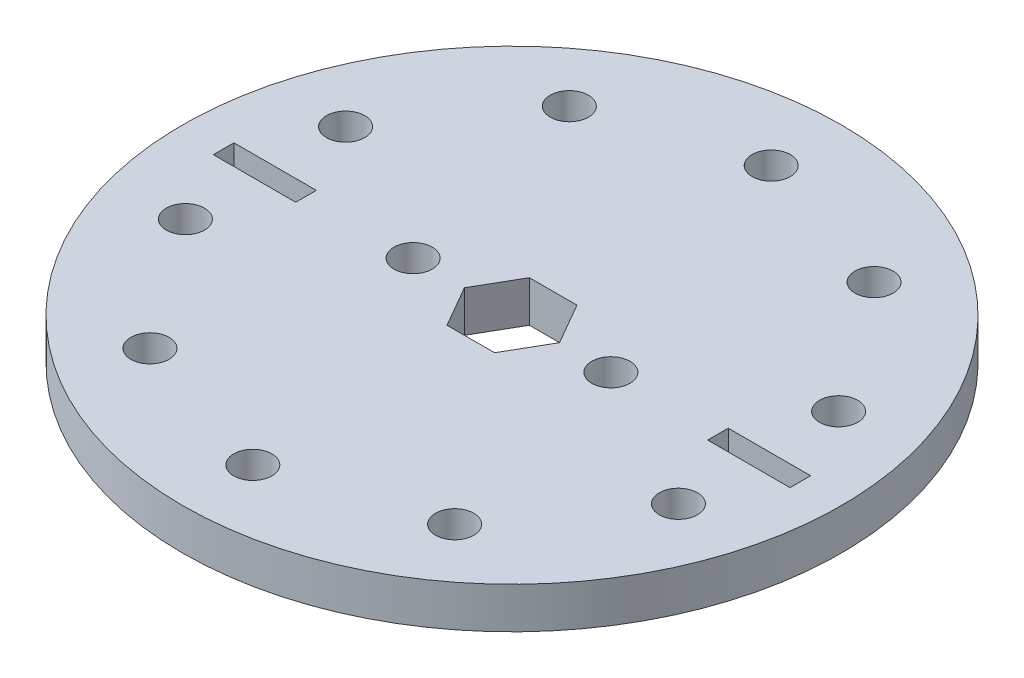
ISO-10303-21;
HEADER;
FILE_DESCRIPTION(('STEP AP214'),'2;1');
FILE_NAME('part.step','',(''),(''),'','','');
FILE_SCHEMA(('AUTOMOTIVE_DESIGN { 1 0 10303 214 1 1 1 1 }'));
ENDSEC;
DATA;
#1=APPLICATION_CONTEXT('core data for automotive mechanical design processes');
#2=APPLICATION_PROTOCOL_DEFINITION('international standard','automotive_design',2000,#1);
#3=PRODUCT_CONTEXT('',#1,'mechanical');
#4=PRODUCT('Part','Part','',(#3));
#5=PRODUCT_RELATED_PRODUCT_CATEGORY('part','',(#4));
#6=PRODUCT_DEFINITION_FORMATION('','',#4);
#7=PRODUCT_DEFINITION_CONTEXT('part definition',#1,'design');
#8=PRODUCT_DEFINITION('design','',#6,#7);
#9=PRODUCT_DEFINITION_SHAPE('','',#8);
#10=(LENGTH_UNIT() NAMED_UNIT(*) SI_UNIT(.MILLI.,.METRE.));
#11=(NAMED_UNIT(*) PLANE_ANGLE_UNIT() SI_UNIT($,.RADIAN.));
#12=(NAMED_UNIT(*) SI_UNIT($,.STERADIAN.) SOLID_ANGLE_UNIT());
#13=UNCERTAINTY_MEASURE_WITH_UNIT(LENGTH_MEASURE(1.E-05),#10,'distance_accuracy_value','');
#14=(GEOMETRIC_REPRESENTATION_CONTEXT(3) GLOBAL_UNCERTAINTY_ASSIGNED_CONTEXT((#13)) GLOBAL_UNIT_ASSIGNED_CONTEXT((#10,
#11,#12)) REPRESENTATION_CONTEXT('',''));
#15=CARTESIAN_POINT('',(0.,0.,0.));
#16=DIRECTION('',(0.,0.,1.));
#17=DIRECTION('',(1.,0.,0.));
#18=AXIS2_PLACEMENT_3D('',#15,#16,#17);
#19=CARTESIAN_POINT('',(0.,3.175,0.));
#20=DIRECTION('',(0.,1.,0.));
#21=DIRECTION('',(0.,0.,1.));
#22=AXIS2_PLACEMENT_3D('',#19,#20,#21);
#23=PLANE('',#22);
#24=DIRECTION('',(-1.,0.,0.));
#25=VECTOR('',#24,1.);
#26=CARTESIAN_POINT('',(22.225,3.175,-0.793749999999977));
#27=LINE('',#26,#25);
#28=CARTESIAN_POINT('',(22.225,3.175,-0.793749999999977));
#29=VERTEX_POINT('',#28);
#30=CARTESIAN_POINT('',(15.875,3.175,-0.793749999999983));
#31=VERTEX_POINT('',#30);
#32=EDGE_CURVE('E48',#29,#31,#27,.T.);
#33=ORIENTED_EDGE('',*,*,#32,.F.);
#34=DIRECTION('',(0.,0.,-1.));
#35=VECTOR('',#34,1.);
#36=CARTESIAN_POINT('',(22.225,3.175,-0.793749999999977));
#37=LINE('',#36,#35);
#38=CARTESIAN_POINT('',(22.225,3.175,0.793750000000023));
#39=VERTEX_POINT('',#38);
#40=EDGE_CURVE('E152',#39,#29,#37,.T.);
#41=ORIENTED_EDGE('',*,*,#40,.F.);
#42=DIRECTION('',(1.,0.,0.));
#43=VECTOR('',#42,1.);
#44=CARTESIAN_POINT('',(22.225,3.175,0.793750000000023));
#45=LINE('',#44,#43);
#46=CARTESIAN_POINT('',(15.875,3.175,0.793750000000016));
#47=VERTEX_POINT('',#46);
#48=EDGE_CURVE('E155',#47,#39,#45,.T.);
#49=ORIENTED_EDGE('',*,*,#48,.F.);
#50=DIRECTION('',(0.,0.,1.));
#51=VECTOR('',#50,1.);
#52=CARTESIAN_POINT('',(15.875,3.175,-0.793749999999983));
#53=LINE('',#52,#51);
#54=EDGE_CURVE('E161',#31,#47,#53,.T.);
#55=ORIENTED_EDGE('',*,*,#54,.F.);
#56=EDGE_LOOP('',(#33,#41,#49,#55));
#57=FACE_BOUND('',#56,.T.);
#58=DIRECTION('',(0.,0.,1.));
#59=VECTOR('',#58,1.);
#60=CARTESIAN_POINT('',(-22.225,3.175,-0.79375));
#61=LINE('',#60,#59);
#62=CARTESIAN_POINT('',(-22.225,3.175,-0.79375));
#63=VERTEX_POINT('',#62);
#64=CARTESIAN_POINT('',(-22.225,3.175,0.793750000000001));
#65=VERTEX_POINT('',#64);
#66=EDGE_CURVE('E167',#63,#65,#61,.T.);
#67=ORIENTED_EDGE('',*,*,#66,.F.);
#68=DIRECTION('',(-1.,0.,0.));
#69=VECTOR('',#68,1.);
#70=CARTESIAN_POINT('',(-22.225,3.175,-0.79375));
#71=LINE('',#70,#69);
#72=CARTESIAN_POINT('',(-15.875,3.175,-0.793749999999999));
#73=VERTEX_POINT('',#72);
#74=EDGE_CURVE('E175',#73,#63,#71,.T.);
#75=ORIENTED_EDGE('',*,*,#74,.F.);
#76=DIRECTION('',(0.,0.,-1.));
#77=VECTOR('',#76,1.);
#78=CARTESIAN_POINT('',(-15.875,3.175,-0.793749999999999));
#79=LINE('',#78,#77);
#80=CARTESIAN_POINT('',(-15.875,3.175,0.793750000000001));
#81=VERTEX_POINT('',#80);
#82=EDGE_CURVE('E189',#81,#73,#79,.T.);
#83=ORIENTED_EDGE('',*,*,#82,.F.);
#84=DIRECTION('',(1.,0.,0.));
#85=VECTOR('',#84,1.);
#86=CARTESIAN_POINT('',(-22.225,3.175,0.793750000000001));
#87=LINE('',#86,#85);
#88=EDGE_CURVE('E186',#65,#81,#87,.T.);
#89=ORIENTED_EDGE('',*,*,#88,.F.);
#90=EDGE_LOOP('',(#67,#75,#83,#89));
#91=FACE_BOUND('',#90,.T.);
#92=CARTESIAN_POINT('',(0.,3.175,-19.9777822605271));
#93=DIRECTION('',(0.,1.,0.));
#94=DIRECTION('',(0.,0.,1.));
#95=AXIS2_PLACEMENT_3D('',#92,#93,#94);
#96=CIRCLE('',#95,1.4732);
#97=CARTESIAN_POINT('',(0.,3.175,-18.5045822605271));
#98=VERTEX_POINT('',#97);
#99=EDGE_CURVE('E196',#98,#98,#96,.T.);
#100=ORIENTED_EDGE('',*,*,#99,.F.);
#101=EDGE_LOOP('',(#100));
#102=FACE_BOUND('',#101,.T.);
#103=CARTESIAN_POINT('',(-11.742645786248,3.175,-16.1623653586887));
#104=DIRECTION('',(0.,1.,0.));
#105=DIRECTION('',(0.,0.,1.));
#106=AXIS2_PLACEMENT_3D('',#103,#104,#105);
#107=CIRCLE('',#106,1.4732);
#108=CARTESIAN_POINT('',(-11.742645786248,3.175,-14.6891653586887));
#109=VERTEX_POINT('',#108);
#110=EDGE_CURVE('E208',#109,#109,#107,.T.);
#111=ORIENTED_EDGE('',*,*,#110,.F.);
#112=EDGE_LOOP('',(#111));
#113=FACE_BOUND('',#112,.T.);
#114=CARTESIAN_POINT('',(-19.,3.175,-6.1734742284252));
#115=DIRECTION('',(0.,1.,0.));
#116=DIRECTION('',(0.,0.,1.));
#117=AXIS2_PLACEMENT_3D('',#114,#115,#116);
#118=CIRCLE('',#117,1.4732);
#119=CARTESIAN_POINT('',(-19.,3.175,-4.70027422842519));
#120=VERTEX_POINT('',#119);
#121=EDGE_CURVE('E214',#120,#120,#118,.T.);
#122=ORIENTED_EDGE('',*,*,#121,.F.);
#123=EDGE_LOOP('',(#122));
#124=FACE_BOUND('',#123,.T.);
#125=CARTESIAN_POINT('',(-19.,3.175,6.17347422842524));
#126=DIRECTION('',(0.,1.,0.));
#127=DIRECTION('',(0.,0.,1.));
#128=AXIS2_PLACEMENT_3D('',#125,#126,#127);
#129=CIRCLE('',#128,1.4732);
#130=CARTESIAN_POINT('',(-19.,3.175,7.64667422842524));
#131=VERTEX_POINT('',#130);
#132=EDGE_CURVE('E220',#131,#131,#129,.T.);
#133=ORIENTED_EDGE('',*,*,#132,.F.);
#134=EDGE_LOOP('',(#133));
#135=FACE_BOUND('',#134,.T.);
#136=CARTESIAN_POINT('',(-11.742645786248,3.175,16.1623653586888));
#137=DIRECTION('',(0.,1.,0.));
#138=DIRECTION('',(0.,0.,1.));
#139=AXIS2_PLACEMENT_3D('',#136,#137,#138);
#140=CIRCLE('',#139,1.4732);
#141=CARTESIAN_POINT('',(-11.742645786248,3.175,17.6355653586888));
#142=VERTEX_POINT('',#141);
#143=EDGE_CURVE('E226',#142,#142,#140,.T.);
#144=ORIENTED_EDGE('',*,*,#143,.F.);
#145=EDGE_LOOP('',(#144));
#146=FACE_BOUND('',#145,.T.);
#147=CARTESIAN_POINT('',(0.,3.175,19.9777822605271));
#148=DIRECTION('',(0.,1.,0.));
#149=DIRECTION('',(0.,0.,1.));
#150=AXIS2_PLACEMENT_3D('',#147,#148,#149);
#151=CIRCLE('',#150,1.4732);
#152=CARTESIAN_POINT('',(0.,3.175,21.4509822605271));
#153=VERTEX_POINT('',#152);
#154=EDGE_CURVE('E232',#153,#153,#151,.T.);
#155=ORIENTED_EDGE('',*,*,#154,.F.);
#156=EDGE_LOOP('',(#155));
#157=FACE_BOUND('',#156,.T.);
#158=CARTESIAN_POINT('',(11.742645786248,3.175,16.1623653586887));
#159=DIRECTION('',(0.,1.,0.));
#160=DIRECTION('',(0.,0.,1.));
#161=AXIS2_PLACEMENT_3D('',#158,#159,#160);
#162=CIRCLE('',#161,1.4732);
#163=CARTESIAN_POINT('',(11.742645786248,3.175,17.6355653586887));
#164=VERTEX_POINT('',#163);
#165=EDGE_CURVE('E238',#164,#164,#162,.T.);
#166=ORIENTED_EDGE('',*,*,#165,.F.);
#167=EDGE_LOOP('',(#166));
#168=FACE_BOUND('',#167,.T.);
#169=CARTESIAN_POINT('',(19.,3.175,6.1734742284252));
#170=DIRECTION('',(0.,1.,0.));
#171=DIRECTION('',(0.,0.,1.));
#172=AXIS2_PLACEMENT_3D('',#169,#170,#171);
#173=CIRCLE('',#172,1.4732);
#174=CARTESIAN_POINT('',(19.,3.175,7.6466742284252));
#175=VERTEX_POINT('',#174);
#176=EDGE_CURVE('E244',#175,#175,#173,.T.);
#177=ORIENTED_EDGE('',*,*,#176,.F.);
#178=EDGE_LOOP('',(#177));
#179=FACE_BOUND('',#178,.T.);
#180=CARTESIAN_POINT('',(19.,3.175,-6.17347422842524));
#181=DIRECTION('',(0.,1.,0.));
#182=DIRECTION('',(0.,0.,1.));
#183=AXIS2_PLACEMENT_3D('',#180,#181,#182);
#184=CIRCLE('',#183,1.4732);
#185=CARTESIAN_POINT('',(19.,3.175,-4.70027422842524));
#186=VERTEX_POINT('',#185);
#187=EDGE_CURVE('E250',#186,#186,#184,.T.);
#188=ORIENTED_EDGE('',*,*,#187,.F.);
#189=EDGE_LOOP('',(#188));
#190=FACE_BOUND('',#189,.T.);
#191=CARTESIAN_POINT('',(11.742645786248,3.175,-16.1623653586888));
#192=DIRECTION('',(0.,1.,0.));
#193=DIRECTION('',(0.,0.,1.));
#194=AXIS2_PLACEMENT_3D('',#191,#192,#193);
#195=CIRCLE('',#194,1.4732);
#196=CARTESIAN_POINT('',(11.742645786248,3.175,-14.6891653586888));
#197=VERTEX_POINT('',#196);
#198=EDGE_CURVE('E256',#197,#197,#195,.T.);
#199=ORIENTED_EDGE('',*,*,#198,.F.);
#200=EDGE_LOOP('',(#199));
#201=FACE_BOUND('',#200,.T.);
#202=CARTESIAN_POINT('',(-7.62,3.175,0.));
#203=DIRECTION('',(0.,1.,0.));
#204=DIRECTION('',(0.,0.,1.));
#205=AXIS2_PLACEMENT_3D('',#202,#203,#204);
#206=CIRCLE('',#205,1.4732);
#207=CARTESIAN_POINT('',(-7.62,3.175,1.4732));
#208=VERTEX_POINT('',#207);
#209=EDGE_CURVE('E262',#208,#208,#206,.T.);
#210=ORIENTED_EDGE('',*,*,#209,.F.);
#211=EDGE_LOOP('',(#210));
#212=FACE_BOUND('',#211,.T.);
#213=CARTESIAN_POINT('',(7.62,3.175,0.));
#214=DIRECTION('',(0.,1.,0.));
#215=DIRECTION('',(0.,0.,1.));
#216=AXIS2_PLACEMENT_3D('',#213,#214,#215);
#217=CIRCLE('',#216,1.4732);
#218=CARTESIAN_POINT('',(7.62,3.175,1.4732));
#219=VERTEX_POINT('',#218);
#220=EDGE_CURVE('E268',#219,#219,#217,.T.);
#221=ORIENTED_EDGE('',*,*,#220,.F.);
#222=EDGE_LOOP('',(#221));
#223=FACE_BOUND('',#222,.T.);
#224=CARTESIAN_POINT('',(0.,3.175,0.));
#225=DIRECTION('',(0.,1.,0.));
#226=DIRECTION('',(0.,0.,1.));
#227=AXIS2_PLACEMENT_3D('',#224,#225,#226);
#228=CIRCLE('',#227,25.4);
#229=CARTESIAN_POINT('',(0.,3.175,25.4));
#230=VERTEX_POINT('',#229);
#231=EDGE_CURVE('E11',#230,#230,#228,.T.);
#232=ORIENTED_EDGE('',*,*,#231,.T.);
#233=EDGE_LOOP('',(#232));
#234=FACE_BOUND('',#233,.T.);
#235=DIRECTION('',(-1.,0.,0.));
#236=VECTOR('',#235,1.);
#237=CARTESIAN_POINT('',(1.83308710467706,3.175,-3.175));
#238=LINE('',#237,#236);
#239=CARTESIAN_POINT('',(1.83308710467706,3.175,-3.175));
#240=VERTEX_POINT('',#239);
#241=CARTESIAN_POINT('',(-1.83308710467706,3.175,-3.175));
#242=VERTEX_POINT('',#241);
#243=EDGE_CURVE('E277',#240,#242,#238,.T.);
#244=ORIENTED_EDGE('',*,*,#243,.F.);
#245=DIRECTION('',(-0.5,0.,-0.866025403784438));
#246=VECTOR('',#245,1.);
#247=CARTESIAN_POINT('',(3.66617420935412,3.175,0.));
#248=LINE('',#247,#246);
#249=CARTESIAN_POINT('',(3.66617420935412,3.175,0.));
#250=VERTEX_POINT('',#249);
#251=EDGE_CURVE('E275',#250,#240,#248,.T.);
#252=ORIENTED_EDGE('',*,*,#251,.F.);
#253=DIRECTION('',(0.5,0.,-0.866025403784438));
#254=VECTOR('',#253,1.);
#255=CARTESIAN_POINT('',(1.83308710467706,3.175,3.175));
#256=LINE('',#255,#254);
#257=CARTESIAN_POINT('',(1.83308710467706,3.175,3.175));
#258=VERTEX_POINT('',#257);
#259=EDGE_CURVE('E287',#258,#250,#256,.T.);
#260=ORIENTED_EDGE('',*,*,#259,.F.);
#261=DIRECTION('',(1.,0.,0.));
#262=VECTOR('',#261,1.);
#263=CARTESIAN_POINT('',(-1.83308710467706,3.175,3.175));
#264=LINE('',#263,#262);
#265=CARTESIAN_POINT('',(-1.83308710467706,3.175,3.175));
#266=VERTEX_POINT('',#265);
#267=EDGE_CURVE('E284',#266,#258,#264,.T.);
#268=ORIENTED_EDGE('',*,*,#267,.F.);
#269=DIRECTION('',(0.5,0.,0.866025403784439));
#270=VECTOR('',#269,1.);
#271=CARTESIAN_POINT('',(-3.66617420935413,3.175,0.));
#272=LINE('',#271,#270);
#273=CARTESIAN_POINT('',(-3.66617420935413,3.175,0.));
#274=VERTEX_POINT('',#273);
#275=EDGE_CURVE('E282',#274,#266,#272,.T.);
#276=ORIENTED_EDGE('',*,*,#275,.F.);
#277=DIRECTION('',(-0.5,0.,0.866025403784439));
#278=VECTOR('',#277,1.);
#279=CARTESIAN_POINT('',(-1.83308710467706,3.175,-3.175));
#280=LINE('',#279,#278);
#281=EDGE_CURVE('E280',#242,#274,#280,.T.);
#282=ORIENTED_EDGE('',*,*,#281,.F.);
#283=EDGE_LOOP('',(#244,#252,#260,#268,#276,#282));
#284=FACE_BOUND('',#283,.T.);
#285=ADVANCED_FACE('F33',(#57,#91,#102,#113,#124,#135,#146,#157,#168,#179,#190,#201,#212,#223,
#234,#284),#23,.T.);
#286=CARTESIAN_POINT('',(0.,0.,0.));
#287=DIRECTION('',(0.,1.,0.));
#288=DIRECTION('',(0.,0.,1.));
#289=AXIS2_PLACEMENT_3D('',#286,#287,#288);
#290=PLANE('',#289);
#291=DIRECTION('',(0.,0.,-1.));
#292=VECTOR('',#291,1.);
#293=CARTESIAN_POINT('',(22.225,0.,-0.793749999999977));
#294=LINE('',#293,#292);
#295=CARTESIAN_POINT('',(22.225,0.,0.793750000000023));
#296=VERTEX_POINT('',#295);
#297=CARTESIAN_POINT('',(22.225,0.,-0.793749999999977));
#298=VERTEX_POINT('',#297);
#299=EDGE_CURVE('E142',#296,#298,#294,.T.);
#300=ORIENTED_EDGE('',*,*,#299,.T.);
#301=DIRECTION('',(-1.,0.,0.));
#302=VECTOR('',#301,1.);
#303=CARTESIAN_POINT('',(22.225,0.,-0.793749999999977));
#304=LINE('',#303,#302);
#305=CARTESIAN_POINT('',(15.875,0.,-0.793749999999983));
#306=VERTEX_POINT('',#305);
#307=EDGE_CURVE('E136',#298,#306,#304,.T.);
#308=ORIENTED_EDGE('',*,*,#307,.T.);
#309=DIRECTION('',(0.,0.,1.));
#310=VECTOR('',#309,1.);
#311=CARTESIAN_POINT('',(15.875,0.,-0.793749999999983));
#312=LINE('',#311,#310);
#313=CARTESIAN_POINT('',(15.875,0.,0.793750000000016));
#314=VERTEX_POINT('',#313);
#315=EDGE_CURVE('E145',#306,#314,#312,.T.);
#316=ORIENTED_EDGE('',*,*,#315,.T.);
#317=DIRECTION('',(1.,0.,0.));
#318=VECTOR('',#317,1.);
#319=CARTESIAN_POINT('',(22.225,0.,0.793750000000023));
#320=LINE('',#319,#318);
#321=EDGE_CURVE('E56',#314,#296,#320,.T.);
#322=ORIENTED_EDGE('',*,*,#321,.T.);
#323=EDGE_LOOP('',(#300,#308,#316,#322));
#324=FACE_BOUND('',#323,.T.);
#325=DIRECTION('',(-1.,0.,0.));
#326=VECTOR('',#325,1.);
#327=CARTESIAN_POINT('',(-22.225,0.,-0.79375));
#328=LINE('',#327,#326);
#329=CARTESIAN_POINT('',(-15.875,0.,-0.793749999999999));
#330=VERTEX_POINT('',#329);
#331=CARTESIAN_POINT('',(-22.225,0.,-0.79375));
#332=VERTEX_POINT('',#331);
#333=EDGE_CURVE('E181',#330,#332,#328,.T.);
#334=ORIENTED_EDGE('',*,*,#333,.T.);
#335=DIRECTION('',(0.,0.,1.));
#336=VECTOR('',#335,1.);
#337=CARTESIAN_POINT('',(-22.225,0.,-0.79375));
#338=LINE('',#337,#336);
#339=CARTESIAN_POINT('',(-22.225,0.,0.793750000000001));
#340=VERTEX_POINT('',#339);
#341=EDGE_CURVE('E171',#332,#340,#338,.T.);
#342=ORIENTED_EDGE('',*,*,#341,.T.);
#343=DIRECTION('',(1.,0.,0.));
#344=VECTOR('',#343,1.);
#345=CARTESIAN_POINT('',(-22.225,0.,0.793750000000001));
#346=LINE('',#345,#344);
#347=CARTESIAN_POINT('',(-15.875,0.,0.793750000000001));
#348=VERTEX_POINT('',#347);
#349=EDGE_CURVE('E174',#340,#348,#346,.T.);
#350=ORIENTED_EDGE('',*,*,#349,.T.);
#351=DIRECTION('',(0.,0.,-1.));
#352=VECTOR('',#351,1.);
#353=CARTESIAN_POINT('',(-15.875,0.,-0.793749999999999));
#354=LINE('',#353,#352);
#355=EDGE_CURVE('E178',#348,#330,#354,.T.);
#356=ORIENTED_EDGE('',*,*,#355,.T.);
#357=EDGE_LOOP('',(#334,#342,#350,#356));
#358=FACE_BOUND('',#357,.T.);
#359=CARTESIAN_POINT('',(0.,0.,-19.9777822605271));
#360=DIRECTION('',(0.,1.,0.));
#361=DIRECTION('',(0.,0.,1.));
#362=AXIS2_PLACEMENT_3D('',#359,#360,#361);
#363=CIRCLE('',#362,1.4732);
#364=CARTESIAN_POINT('',(0.,0.,-18.5045822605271));
#365=VERTEX_POINT('',#364);
#366=EDGE_CURVE('E205',#365,#365,#363,.T.);
#367=ORIENTED_EDGE('',*,*,#366,.T.);
#368=EDGE_LOOP('',(#367));
#369=FACE_BOUND('',#368,.T.);
#370=CARTESIAN_POINT('',(-11.742645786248,0.,-16.1623653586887));
#371=DIRECTION('',(0.,1.,0.));
#372=DIRECTION('',(0.,0.,1.));
#373=AXIS2_PLACEMENT_3D('',#370,#371,#372);
#374=CIRCLE('',#373,1.4732);
#375=CARTESIAN_POINT('',(-11.742645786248,0.,-14.6891653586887));
#376=VERTEX_POINT('',#375);
#377=EDGE_CURVE('E211',#376,#376,#374,.T.);
#378=ORIENTED_EDGE('',*,*,#377,.T.);
#379=EDGE_LOOP('',(#378));
#380=FACE_BOUND('',#379,.T.);
#381=CARTESIAN_POINT('',(-19.,0.,-6.1734742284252));
#382=DIRECTION('',(0.,1.,0.));
#383=DIRECTION('',(0.,0.,1.));
#384=AXIS2_PLACEMENT_3D('',#381,#382,#383);
#385=CIRCLE('',#384,1.4732);
#386=CARTESIAN_POINT('',(-19.,0.,-4.7002742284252));
#387=VERTEX_POINT('',#386);
#388=EDGE_CURVE('E217',#387,#387,#385,.T.);
#389=ORIENTED_EDGE('',*,*,#388,.T.);
#390=EDGE_LOOP('',(#389));
#391=FACE_BOUND('',#390,.T.);
#392=CARTESIAN_POINT('',(-19.,0.,6.17347422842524));
#393=DIRECTION('',(0.,1.,0.));
#394=DIRECTION('',(0.,0.,1.));
#395=AXIS2_PLACEMENT_3D('',#392,#393,#394);
#396=CIRCLE('',#395,1.4732);
#397=CARTESIAN_POINT('',(-19.,0.,7.64667422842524));
#398=VERTEX_POINT('',#397);
#399=EDGE_CURVE('E223',#398,#398,#396,.T.);
#400=ORIENTED_EDGE('',*,*,#399,.T.);
#401=EDGE_LOOP('',(#400));
#402=FACE_BOUND('',#401,.T.);
#403=CARTESIAN_POINT('',(-11.742645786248,0.,16.1623653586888));
#404=DIRECTION('',(0.,1.,0.));
#405=DIRECTION('',(0.,0.,1.));
#406=AXIS2_PLACEMENT_3D('',#403,#404,#405);
#407=CIRCLE('',#406,1.4732);
#408=CARTESIAN_POINT('',(-11.742645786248,0.,17.6355653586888));
#409=VERTEX_POINT('',#408);
#410=EDGE_CURVE('E229',#409,#409,#407,.T.);
#411=ORIENTED_EDGE('',*,*,#410,.T.);
#412=EDGE_LOOP('',(#411));
#413=FACE_BOUND('',#412,.T.);
#414=CARTESIAN_POINT('',(0.,0.,19.9777822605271));
#415=DIRECTION('',(0.,1.,0.));
#416=DIRECTION('',(0.,0.,1.));
#417=AXIS2_PLACEMENT_3D('',#414,#415,#416);
#418=CIRCLE('',#417,1.4732);
#419=CARTESIAN_POINT('',(0.,0.,21.4509822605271));
#420=VERTEX_POINT('',#419);
#421=EDGE_CURVE('E235',#420,#420,#418,.T.);
#422=ORIENTED_EDGE('',*,*,#421,.T.);
#423=EDGE_LOOP('',(#422));
#424=FACE_BOUND('',#423,.T.);
#425=CARTESIAN_POINT('',(11.742645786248,0.,16.1623653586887));
#426=DIRECTION('',(0.,1.,0.));
#427=DIRECTION('',(0.,0.,1.));
#428=AXIS2_PLACEMENT_3D('',#425,#426,#427);
#429=CIRCLE('',#428,1.4732);
#430=CARTESIAN_POINT('',(11.742645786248,0.,17.6355653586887));
#431=VERTEX_POINT('',#430);
#432=EDGE_CURVE('E241',#431,#431,#429,.T.);
#433=ORIENTED_EDGE('',*,*,#432,.T.);
#434=EDGE_LOOP('',(#433));
#435=FACE_BOUND('',#434,.T.);
#436=CARTESIAN_POINT('',(19.,0.,6.1734742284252));
#437=DIRECTION('',(0.,1.,0.));
#438=DIRECTION('',(0.,0.,1.));
#439=AXIS2_PLACEMENT_3D('',#436,#437,#438);
#440=CIRCLE('',#439,1.4732);
#441=CARTESIAN_POINT('',(19.,0.,7.6466742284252));
#442=VERTEX_POINT('',#441);
#443=EDGE_CURVE('E247',#442,#442,#440,.T.);
#444=ORIENTED_EDGE('',*,*,#443,.T.);
#445=EDGE_LOOP('',(#444));
#446=FACE_BOUND('',#445,.T.);
#447=CARTESIAN_POINT('',(19.,0.,-6.17347422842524));
#448=DIRECTION('',(0.,1.,0.));
#449=DIRECTION('',(0.,0.,1.));
#450=AXIS2_PLACEMENT_3D('',#447,#448,#449);
#451=CIRCLE('',#450,1.4732);
#452=CARTESIAN_POINT('',(19.,0.,-4.70027422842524));
#453=VERTEX_POINT('',#452);
#454=EDGE_CURVE('E253',#453,#453,#451,.T.);
#455=ORIENTED_EDGE('',*,*,#454,.T.);
#456=EDGE_LOOP('',(#455));
#457=FACE_BOUND('',#456,.T.);
#458=CARTESIAN_POINT('',(11.742645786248,0.,-16.1623653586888));
#459=DIRECTION('',(0.,1.,0.));
#460=DIRECTION('',(0.,0.,1.));
#461=AXIS2_PLACEMENT_3D('',#458,#459,#460);
#462=CIRCLE('',#461,1.4732);
#463=CARTESIAN_POINT('',(11.742645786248,0.,-14.6891653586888));
#464=VERTEX_POINT('',#463);
#465=EDGE_CURVE('E259',#464,#464,#462,.T.);
#466=ORIENTED_EDGE('',*,*,#465,.T.);
#467=EDGE_LOOP('',(#466));
#468=FACE_BOUND('',#467,.T.);
#469=CARTESIAN_POINT('',(-7.62,0.,0.));
#470=DIRECTION('',(0.,1.,0.));
#471=DIRECTION('',(0.,0.,1.));
#472=AXIS2_PLACEMENT_3D('',#469,#470,#471);
#473=CIRCLE('',#472,1.4732);
#474=CARTESIAN_POINT('',(-7.62,0.,1.4732));
#475=VERTEX_POINT('',#474);
#476=EDGE_CURVE('E265',#475,#475,#473,.T.);
#477=ORIENTED_EDGE('',*,*,#476,.T.);
#478=EDGE_LOOP('',(#477));
#479=FACE_BOUND('',#478,.T.);
#480=CARTESIAN_POINT('',(7.62,0.,0.));
#481=DIRECTION('',(0.,1.,0.));
#482=DIRECTION('',(0.,0.,1.));
#483=AXIS2_PLACEMENT_3D('',#480,#481,#482);
#484=CIRCLE('',#483,1.4732);
#485=CARTESIAN_POINT('',(7.62,0.,1.4732));
#486=VERTEX_POINT('',#485);
#487=EDGE_CURVE('E271',#486,#486,#484,.T.);
#488=ORIENTED_EDGE('',*,*,#487,.T.);
#489=EDGE_LOOP('',(#488));
#490=FACE_BOUND('',#489,.T.);
#491=CARTESIAN_POINT('',(0.,0.,0.));
#492=DIRECTION('',(0.,1.,0.));
#493=DIRECTION('',(0.,0.,1.));
#494=AXIS2_PLACEMENT_3D('',#491,#492,#493);
#495=CIRCLE('',#494,25.4);
#496=CARTESIAN_POINT('',(0.,0.,25.4));
#497=VERTEX_POINT('',#496);
#498=EDGE_CURVE('E37',#497,#497,#495,.T.);
#499=ORIENTED_EDGE('',*,*,#498,.F.);
#500=EDGE_LOOP('',(#499));
#501=FACE_BOUND('',#500,.T.);
#502=DIRECTION('',(-0.5,0.,-0.866025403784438));
#503=VECTOR('',#502,1.);
#504=CARTESIAN_POINT('',(3.66617420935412,0.,0.));
#505=LINE('',#504,#503);
#506=CARTESIAN_POINT('',(3.66617420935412,0.,0.));
#507=VERTEX_POINT('',#506);
#508=CARTESIAN_POINT('',(1.83308710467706,0.,-3.175));
#509=VERTEX_POINT('',#508);
#510=EDGE_CURVE('E274',#507,#509,#505,.T.);
#511=ORIENTED_EDGE('',*,*,#510,.T.);
#512=DIRECTION('',(-1.,0.,0.));
#513=VECTOR('',#512,1.);
#514=CARTESIAN_POINT('',(1.83308710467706,0.,-3.175));
#515=LINE('',#514,#513);
#516=CARTESIAN_POINT('',(-1.83308710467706,0.,-3.175));
#517=VERTEX_POINT('',#516);
#518=EDGE_CURVE('E292',#509,#517,#515,.T.);
#519=ORIENTED_EDGE('',*,*,#518,.T.);
#520=DIRECTION('',(-0.5,0.,0.866025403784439));
#521=VECTOR('',#520,1.);
#522=CARTESIAN_POINT('',(-1.83308710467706,0.,-3.175));
#523=LINE('',#522,#521);
#524=CARTESIAN_POINT('',(-3.66617420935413,0.,0.));
#525=VERTEX_POINT('',#524);
#526=EDGE_CURVE('E295',#517,#525,#523,.T.);
#527=ORIENTED_EDGE('',*,*,#526,.T.);
#528=DIRECTION('',(0.5,0.,0.866025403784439));
#529=VECTOR('',#528,1.);
#530=CARTESIAN_POINT('',(-3.66617420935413,0.,0.));
#531=LINE('',#530,#529);
#532=CARTESIAN_POINT('',(-1.83308710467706,0.,3.175));
#533=VERTEX_POINT('',#532);
#534=EDGE_CURVE('E298',#525,#533,#531,.T.);
#535=ORIENTED_EDGE('',*,*,#534,.T.);
#536=DIRECTION('',(1.,0.,0.));
#537=VECTOR('',#536,1.);
#538=CARTESIAN_POINT('',(-1.83308710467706,0.,3.175));
#539=LINE('',#538,#537);
#540=CARTESIAN_POINT('',(1.83308710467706,0.,3.175));
#541=VERTEX_POINT('',#540);
#542=EDGE_CURVE('E301',#533,#541,#539,.T.);
#543=ORIENTED_EDGE('',*,*,#542,.T.);
#544=DIRECTION('',(0.5,0.,-0.866025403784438));
#545=VECTOR('',#544,1.);
#546=CARTESIAN_POINT('',(1.83308710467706,0.,3.175));
#547=LINE('',#546,#545);
#548=EDGE_CURVE('E278',#541,#507,#547,.T.);
#549=ORIENTED_EDGE('',*,*,#548,.T.);
#550=EDGE_LOOP('',(#511,#519,#527,#535,#543,#549));
#551=FACE_BOUND('',#550,.T.);
#552=ADVANCED_FACE('F149',(#324,#358,#369,#380,#391,#402,#413,#424,#435,#446,#457,#468,#479,
#490,#501,#551),#290,.F.);
#553=CARTESIAN_POINT('',(0.,3.175,0.));
#554=DIRECTION('',(0.,-1.,0.));
#555=DIRECTION('',(0.,0.,-1.));
#556=AXIS2_PLACEMENT_3D('',#553,#554,#555);
#557=CYLINDRICAL_SURFACE('',#556,25.4);
#558=ORIENTED_EDGE('',*,*,#231,.F.);
#559=EDGE_LOOP('',(#558));
#560=FACE_BOUND('',#559,.T.);
#561=ORIENTED_EDGE('',*,*,#498,.T.);
#562=EDGE_LOOP('',(#561));
#563=FACE_BOUND('',#562,.T.);
#564=ADVANCED_FACE('F35',(#560,#563),#557,.T.);
#565=CARTESIAN_POINT('',(3.66617420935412,3.175,0.));
#566=DIRECTION('',(-0.866025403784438,0.,0.5));
#567=DIRECTION('',(0.500000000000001,0.,0.866025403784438));
#568=AXIS2_PLACEMENT_3D('',#565,#566,#567);
#569=PLANE('',#568);
#570=ORIENTED_EDGE('',*,*,#510,.F.);
#571=DIRECTION('',(0.,-1.,0.));
#572=VECTOR('',#571,1.);
#573=CARTESIAN_POINT('',(3.66617420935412,3.175,0.));
#574=LINE('',#573,#572);
#575=EDGE_CURVE('E289',#250,#507,#574,.T.);
#576=ORIENTED_EDGE('',*,*,#575,.F.);
#577=ORIENTED_EDGE('',*,*,#251,.T.);
#578=DIRECTION('',(0.,-1.,0.));
#579=VECTOR('',#578,1.);
#580=CARTESIAN_POINT('',(1.83308710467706,3.175,-3.175));
#581=LINE('',#580,#579);
#582=EDGE_CURVE('E316',#240,#509,#581,.T.);
#583=ORIENTED_EDGE('',*,*,#582,.T.);
#584=EDGE_LOOP('',(#570,#576,#577,#583));
#585=FACE_BOUND('',#584,.T.);
#586=ADVANCED_FACE('F328',(#585),#569,.T.);
#587=CARTESIAN_POINT('',(1.83308710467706,3.175,-3.175));
#588=DIRECTION('',(0.,0.,1.));
#589=DIRECTION('',(1.,0.,0.));
#590=AXIS2_PLACEMENT_3D('',#587,#588,#589);
#591=PLANE('',#590);
#592=ORIENTED_EDGE('',*,*,#518,.F.);
#593=ORIENTED_EDGE('',*,*,#582,.F.);
#594=ORIENTED_EDGE('',*,*,#243,.T.);
#595=DIRECTION('',(0.,-1.,0.));
#596=VECTOR('',#595,1.);
#597=CARTESIAN_POINT('',(-1.83308710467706,3.175,-3.175));
#598=LINE('',#597,#596);
#599=EDGE_CURVE('E314',#242,#517,#598,.T.);
#600=ORIENTED_EDGE('',*,*,#599,.T.);
#601=EDGE_LOOP('',(#592,#593,#594,#600));
#602=FACE_BOUND('',#601,.T.);
#603=ADVANCED_FACE('F339',(#602),#591,.T.);
#604=CARTESIAN_POINT('',(-1.83308710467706,3.175,-3.175));
#605=DIRECTION('',(0.866025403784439,0.,0.5));
#606=DIRECTION('',(0.5,0.,-0.866025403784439));
#607=AXIS2_PLACEMENT_3D('',#604,#605,#606);
#608=PLANE('',#607);
#609=ORIENTED_EDGE('',*,*,#526,.F.);
#610=ORIENTED_EDGE('',*,*,#599,.F.);
#611=ORIENTED_EDGE('',*,*,#281,.T.);
#612=DIRECTION('',(0.,-1.,0.));
#613=VECTOR('',#612,1.);
#614=CARTESIAN_POINT('',(-3.66617420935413,3.175,0.));
#615=LINE('',#614,#613);
#616=EDGE_CURVE('E312',#274,#525,#615,.T.);
#617=ORIENTED_EDGE('',*,*,#616,.T.);
#618=EDGE_LOOP('',(#609,#610,#611,#617));
#619=FACE_BOUND('',#618,.T.);
#620=ADVANCED_FACE('F343',(#619),#608,.T.);
#621=CARTESIAN_POINT('',(-3.66617420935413,3.175,0.));
#622=DIRECTION('',(0.866025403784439,0.,-0.5));
#623=DIRECTION('',(-0.5,0.,-0.866025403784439));
#624=AXIS2_PLACEMENT_3D('',#621,#622,#623);
#625=PLANE('',#624);
#626=ORIENTED_EDGE('',*,*,#534,.F.);
#627=ORIENTED_EDGE('',*,*,#616,.F.);
#628=ORIENTED_EDGE('',*,*,#275,.T.);
#629=DIRECTION('',(0.,-1.,0.));
#630=VECTOR('',#629,1.);
#631=CARTESIAN_POINT('',(-1.83308710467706,3.175,3.175));
#632=LINE('',#631,#630);
#633=EDGE_CURVE('E310',#266,#533,#632,.T.);
#634=ORIENTED_EDGE('',*,*,#633,.T.);
#635=EDGE_LOOP('',(#626,#627,#628,#634));
#636=FACE_BOUND('',#635,.T.);
#637=ADVANCED_FACE('F348',(#636),#625,.T.);
#638=CARTESIAN_POINT('',(-1.83308710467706,3.175,3.175));
#639=DIRECTION('',(0.,0.,-1.));
#640=DIRECTION('',(-1.,0.,0.));
#641=AXIS2_PLACEMENT_3D('',#638,#639,#640);
#642=PLANE('',#641);
#643=ORIENTED_EDGE('',*,*,#542,.F.);
#644=ORIENTED_EDGE('',*,*,#633,.F.);
#645=ORIENTED_EDGE('',*,*,#267,.T.);
#646=DIRECTION('',(0.,-1.,0.));
#647=VECTOR('',#646,1.);
#648=CARTESIAN_POINT('',(1.83308710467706,3.175,3.175));
#649=LINE('',#648,#647);
#650=EDGE_CURVE('E308',#258,#541,#649,.T.);
#651=ORIENTED_EDGE('',*,*,#650,.T.);
#652=EDGE_LOOP('',(#643,#644,#645,#651));
#653=FACE_BOUND('',#652,.T.);
#654=ADVANCED_FACE('F351',(#653),#642,.T.);
#655=CARTESIAN_POINT('',(1.83308710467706,3.175,3.175));
#656=DIRECTION('',(-0.866025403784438,0.,-0.5));
#657=DIRECTION('',(-0.5,0.,0.866025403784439));
#658=AXIS2_PLACEMENT_3D('',#655,#656,#657);
#659=PLANE('',#658);
#660=ORIENTED_EDGE('',*,*,#548,.F.);
#661=ORIENTED_EDGE('',*,*,#650,.F.);
#662=ORIENTED_EDGE('',*,*,#259,.T.);
#663=ORIENTED_EDGE('',*,*,#575,.T.);
#664=EDGE_LOOP('',(#660,#661,#662,#663));
#665=FACE_BOUND('',#664,.T.);
#666=ADVANCED_FACE('F331',(#665),#659,.T.);
#667=CARTESIAN_POINT('',(7.62,3.175,0.));
#668=DIRECTION('',(0.,1.,0.));
#669=DIRECTION('',(0.,0.,1.));
#670=AXIS2_PLACEMENT_3D('',#667,#668,#669);
#671=CYLINDRICAL_SURFACE('',#670,1.4732);
#672=ORIENTED_EDGE('',*,*,#487,.F.);
#673=EDGE_LOOP('',(#672));
#674=FACE_BOUND('',#673,.T.);
#675=ORIENTED_EDGE('',*,*,#220,.T.);
#676=EDGE_LOOP('',(#675));
#677=FACE_BOUND('',#676,.T.);
#678=ADVANCED_FACE('F358',(#674,#677),#671,.F.);
#679=CARTESIAN_POINT('',(-7.62,3.175,0.));
#680=DIRECTION('',(0.,1.,0.));
#681=DIRECTION('',(0.,0.,1.));
#682=AXIS2_PLACEMENT_3D('',#679,#680,#681);
#683=CYLINDRICAL_SURFACE('',#682,1.4732);
#684=ORIENTED_EDGE('',*,*,#476,.F.);
#685=EDGE_LOOP('',(#684));
#686=FACE_BOUND('',#685,.T.);
#687=ORIENTED_EDGE('',*,*,#209,.T.);
#688=EDGE_LOOP('',(#687));
#689=FACE_BOUND('',#688,.T.);
#690=ADVANCED_FACE('F400',(#686,#689),#683,.F.);
#691=CARTESIAN_POINT('',(11.742645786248,3.175,-16.1623653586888));
#692=DIRECTION('',(0.,1.,0.));
#693=DIRECTION('',(0.,0.,1.));
#694=AXIS2_PLACEMENT_3D('',#691,#692,#693);
#695=CYLINDRICAL_SURFACE('',#694,1.4732);
#696=ORIENTED_EDGE('',*,*,#465,.F.);
#697=EDGE_LOOP('',(#696));
#698=FACE_BOUND('',#697,.T.);
#699=ORIENTED_EDGE('',*,*,#198,.T.);
#700=EDGE_LOOP('',(#699));
#701=FACE_BOUND('',#700,.T.);
#702=ADVANCED_FACE('F410',(#698,#701),#695,.F.);
#703=CARTESIAN_POINT('',(19.,3.175,-6.17347422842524));
#704=DIRECTION('',(0.,1.,0.));
#705=DIRECTION('',(0.,0.,1.));
#706=AXIS2_PLACEMENT_3D('',#703,#704,#705);
#707=CYLINDRICAL_SURFACE('',#706,1.4732);
#708=ORIENTED_EDGE('',*,*,#454,.F.);
#709=EDGE_LOOP('',(#708));
#710=FACE_BOUND('',#709,.T.);
#711=ORIENTED_EDGE('',*,*,#187,.T.);
#712=EDGE_LOOP('',(#711));
#713=FACE_BOUND('',#712,.T.);
#714=ADVANCED_FACE('F420',(#710,#713),#707,.F.);
#715=CARTESIAN_POINT('',(19.,3.175,6.1734742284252));
#716=DIRECTION('',(0.,1.,0.));
#717=DIRECTION('',(0.,0.,1.));
#718=AXIS2_PLACEMENT_3D('',#715,#716,#717);
#719=CYLINDRICAL_SURFACE('',#718,1.4732);
#720=ORIENTED_EDGE('',*,*,#443,.F.);
#721=EDGE_LOOP('',(#720));
#722=FACE_BOUND('',#721,.T.);
#723=ORIENTED_EDGE('',*,*,#176,.T.);
#724=EDGE_LOOP('',(#723));
#725=FACE_BOUND('',#724,.T.);
#726=ADVANCED_FACE('F430',(#722,#725),#719,.F.);
#727=CARTESIAN_POINT('',(11.742645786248,3.175,16.1623653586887));
#728=DIRECTION('',(0.,1.,0.));
#729=DIRECTION('',(0.,0.,1.));
#730=AXIS2_PLACEMENT_3D('',#727,#728,#729);
#731=CYLINDRICAL_SURFACE('',#730,1.4732);
#732=ORIENTED_EDGE('',*,*,#432,.F.);
#733=EDGE_LOOP('',(#732));
#734=FACE_BOUND('',#733,.T.);
#735=ORIENTED_EDGE('',*,*,#165,.T.);
#736=EDGE_LOOP('',(#735));
#737=FACE_BOUND('',#736,.T.);
#738=ADVANCED_FACE('F440',(#734,#737),#731,.F.);
#739=CARTESIAN_POINT('',(0.,3.175,19.9777822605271));
#740=DIRECTION('',(0.,1.,0.));
#741=DIRECTION('',(0.,0.,1.));
#742=AXIS2_PLACEMENT_3D('',#739,#740,#741);
#743=CYLINDRICAL_SURFACE('',#742,1.4732);
#744=ORIENTED_EDGE('',*,*,#421,.F.);
#745=EDGE_LOOP('',(#744));
#746=FACE_BOUND('',#745,.T.);
#747=ORIENTED_EDGE('',*,*,#154,.T.);
#748=EDGE_LOOP('',(#747));
#749=FACE_BOUND('',#748,.T.);
#750=ADVANCED_FACE('F450',(#746,#749),#743,.F.);
#751=CARTESIAN_POINT('',(-11.742645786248,3.175,16.1623653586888));
#752=DIRECTION('',(0.,1.,0.));
#753=DIRECTION('',(0.,0.,1.));
#754=AXIS2_PLACEMENT_3D('',#751,#752,#753);
#755=CYLINDRICAL_SURFACE('',#754,1.4732);
#756=ORIENTED_EDGE('',*,*,#410,.F.);
#757=EDGE_LOOP('',(#756));
#758=FACE_BOUND('',#757,.T.);
#759=ORIENTED_EDGE('',*,*,#143,.T.);
#760=EDGE_LOOP('',(#759));
#761=FACE_BOUND('',#760,.T.);
#762=ADVANCED_FACE('F460',(#758,#761),#755,.F.);
#763=CARTESIAN_POINT('',(-19.,3.175,6.17347422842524));
#764=DIRECTION('',(0.,1.,0.));
#765=DIRECTION('',(0.,0.,1.));
#766=AXIS2_PLACEMENT_3D('',#763,#764,#765);
#767=CYLINDRICAL_SURFACE('',#766,1.4732);
#768=ORIENTED_EDGE('',*,*,#399,.F.);
#769=EDGE_LOOP('',(#768));
#770=FACE_BOUND('',#769,.T.);
#771=ORIENTED_EDGE('',*,*,#132,.T.);
#772=EDGE_LOOP('',(#771));
#773=FACE_BOUND('',#772,.T.);
#774=ADVANCED_FACE('F470',(#770,#773),#767,.F.);
#775=CARTESIAN_POINT('',(-19.,3.175,-6.1734742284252));
#776=DIRECTION('',(0.,1.,0.));
#777=DIRECTION('',(0.,0.,1.));
#778=AXIS2_PLACEMENT_3D('',#775,#776,#777);
#779=CYLINDRICAL_SURFACE('',#778,1.4732);
#780=ORIENTED_EDGE('',*,*,#388,.F.);
#781=EDGE_LOOP('',(#780));
#782=FACE_BOUND('',#781,.T.);
#783=ORIENTED_EDGE('',*,*,#121,.T.);
#784=EDGE_LOOP('',(#783));
#785=FACE_BOUND('',#784,.T.);
#786=ADVANCED_FACE('F480',(#782,#785),#779,.F.);
#787=CARTESIAN_POINT('',(-11.742645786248,3.175,-16.1623653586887));
#788=DIRECTION('',(0.,1.,0.));
#789=DIRECTION('',(0.,0.,1.));
#790=AXIS2_PLACEMENT_3D('',#787,#788,#789);
#791=CYLINDRICAL_SURFACE('',#790,1.4732);
#792=ORIENTED_EDGE('',*,*,#377,.F.);
#793=EDGE_LOOP('',(#792));
#794=FACE_BOUND('',#793,.T.);
#795=ORIENTED_EDGE('',*,*,#110,.T.);
#796=EDGE_LOOP('',(#795));
#797=FACE_BOUND('',#796,.T.);
#798=ADVANCED_FACE('F490',(#794,#797),#791,.F.);
#799=CARTESIAN_POINT('',(0.,3.175,-19.9777822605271));
#800=DIRECTION('',(0.,1.,0.));
#801=DIRECTION('',(0.,0.,1.));
#802=AXIS2_PLACEMENT_3D('',#799,#800,#801);
#803=CYLINDRICAL_SURFACE('',#802,1.4732);
#804=ORIENTED_EDGE('',*,*,#366,.F.);
#805=EDGE_LOOP('',(#804));
#806=FACE_BOUND('',#805,.T.);
#807=ORIENTED_EDGE('',*,*,#99,.T.);
#808=EDGE_LOOP('',(#807));
#809=FACE_BOUND('',#808,.T.);
#810=ADVANCED_FACE('F500',(#806,#809),#803,.F.);
#811=CARTESIAN_POINT('',(-22.225,0.,-0.79375));
#812=DIRECTION('',(-1.,0.,0.));
#813=DIRECTION('',(0.,0.,1.));
#814=AXIS2_PLACEMENT_3D('',#811,#812,#813);
#815=PLANE('',#814);
#816=ORIENTED_EDGE('',*,*,#66,.T.);
#817=DIRECTION('',(0.,1.,0.));
#818=VECTOR('',#817,1.);
#819=CARTESIAN_POINT('',(-22.225,0.,0.793750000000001));
#820=LINE('',#819,#818);
#821=EDGE_CURVE('E184',#340,#65,#820,.T.);
#822=ORIENTED_EDGE('',*,*,#821,.F.);
#823=ORIENTED_EDGE('',*,*,#341,.F.);
#824=DIRECTION('',(0.,1.,0.));
#825=VECTOR('',#824,1.);
#826=CARTESIAN_POINT('',(-22.225,0.,-0.79375));
#827=LINE('',#826,#825);
#828=EDGE_CURVE('E194',#332,#63,#827,.T.);
#829=ORIENTED_EDGE('',*,*,#828,.T.);
#830=EDGE_LOOP('',(#816,#822,#823,#829));
#831=FACE_BOUND('',#830,.T.);
#832=ADVANCED_FACE('F509',(#831),#815,.F.);
#833=CARTESIAN_POINT('',(-22.225,0.,-0.79375));
#834=DIRECTION('',(0.,0.,-1.));
#835=DIRECTION('',(-1.,0.,0.));
#836=AXIS2_PLACEMENT_3D('',#833,#834,#835);
#837=PLANE('',#836);
#838=ORIENTED_EDGE('',*,*,#74,.T.);
#839=ORIENTED_EDGE('',*,*,#828,.F.);
#840=ORIENTED_EDGE('',*,*,#333,.F.);
#841=DIRECTION('',(0.,1.,0.));
#842=VECTOR('',#841,1.);
#843=CARTESIAN_POINT('',(-15.875,0.,-0.793749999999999));
#844=LINE('',#843,#842);
#845=EDGE_CURVE('E197',#330,#73,#844,.T.);
#846=ORIENTED_EDGE('',*,*,#845,.T.);
#847=EDGE_LOOP('',(#838,#839,#840,#846));
#848=FACE_BOUND('',#847,.T.);
#849=ADVANCED_FACE('F532',(#848),#837,.F.);
#850=CARTESIAN_POINT('',(-15.875,0.,-0.793749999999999));
#851=DIRECTION('',(1.,0.,0.));
#852=DIRECTION('',(0.,0.,-1.));
#853=AXIS2_PLACEMENT_3D('',#850,#851,#852);
#854=PLANE('',#853);
#855=ORIENTED_EDGE('',*,*,#82,.T.);
#856=ORIENTED_EDGE('',*,*,#845,.F.);
#857=ORIENTED_EDGE('',*,*,#355,.F.);
#858=DIRECTION('',(0.,1.,0.));
#859=VECTOR('',#858,1.);
#860=CARTESIAN_POINT('',(-15.875,0.,0.793750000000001));
#861=LINE('',#860,#859);
#862=EDGE_CURVE('E199',#348,#81,#861,.T.);
#863=ORIENTED_EDGE('',*,*,#862,.T.);
#864=EDGE_LOOP('',(#855,#856,#857,#863));
#865=FACE_BOUND('',#864,.T.);
#866=ADVANCED_FACE('F542',(#865),#854,.F.);
#867=CARTESIAN_POINT('',(-22.225,0.,0.793750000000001));
#868=DIRECTION('',(0.,0.,1.));
#869=DIRECTION('',(1.,0.,0.));
#870=AXIS2_PLACEMENT_3D('',#867,#868,#869);
#871=PLANE('',#870);
#872=ORIENTED_EDGE('',*,*,#88,.T.);
#873=ORIENTED_EDGE('',*,*,#862,.F.);
#874=ORIENTED_EDGE('',*,*,#349,.F.);
#875=ORIENTED_EDGE('',*,*,#821,.T.);
#876=EDGE_LOOP('',(#872,#873,#874,#875));
#877=FACE_BOUND('',#876,.T.);
#878=ADVANCED_FACE('F552',(#877),#871,.F.);
#879=CARTESIAN_POINT('',(22.225,0.,-0.793749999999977));
#880=DIRECTION('',(0.,0.,-1.));
#881=DIRECTION('',(-1.,0.,0.));
#882=AXIS2_PLACEMENT_3D('',#879,#880,#881);
#883=PLANE('',#882);
#884=ORIENTED_EDGE('',*,*,#32,.T.);
#885=DIRECTION('',(0.,1.,0.));
#886=VECTOR('',#885,1.);
#887=CARTESIAN_POINT('',(15.875,0.,-0.793749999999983));
#888=LINE('',#887,#886);
#889=EDGE_CURVE('E132',#306,#31,#888,.T.);
#890=ORIENTED_EDGE('',*,*,#889,.F.);
#891=ORIENTED_EDGE('',*,*,#307,.F.);
#892=DIRECTION('',(0.,1.,0.));
#893=VECTOR('',#892,1.);
#894=CARTESIAN_POINT('',(22.225,0.,-0.793749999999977));
#895=LINE('',#894,#893);
#896=EDGE_CURVE('E165',#298,#29,#895,.T.);
#897=ORIENTED_EDGE('',*,*,#896,.T.);
#898=EDGE_LOOP('',(#884,#890,#891,#897));
#899=FACE_BOUND('',#898,.T.);
#900=ADVANCED_FACE('F134',(#899),#883,.F.);
#901=CARTESIAN_POINT('',(22.225,0.,-0.793749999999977));
#902=DIRECTION('',(1.,0.,0.));
#903=DIRECTION('',(0.,0.,-1.));
#904=AXIS2_PLACEMENT_3D('',#901,#902,#903);
#905=PLANE('',#904);
#906=ORIENTED_EDGE('',*,*,#40,.T.);
#907=ORIENTED_EDGE('',*,*,#896,.F.);
#908=ORIENTED_EDGE('',*,*,#299,.F.);
#909=DIRECTION('',(0.,1.,0.));
#910=VECTOR('',#909,1.);
#911=CARTESIAN_POINT('',(22.225,0.,0.793750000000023));
#912=LINE('',#911,#910);
#913=EDGE_CURVE('E168',#296,#39,#912,.T.);
#914=ORIENTED_EDGE('',*,*,#913,.T.);
#915=EDGE_LOOP('',(#906,#907,#908,#914));
#916=FACE_BOUND('',#915,.T.);
#917=ADVANCED_FACE('F571',(#916),#905,.F.);
#918=CARTESIAN_POINT('',(22.225,0.,0.793750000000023));
#919=DIRECTION('',(0.,0.,1.));
#920=DIRECTION('',(1.,0.,0.));
#921=AXIS2_PLACEMENT_3D('',#918,#919,#920);
#922=PLANE('',#921);
#923=ORIENTED_EDGE('',*,*,#48,.T.);
#924=ORIENTED_EDGE('',*,*,#913,.F.);
#925=ORIENTED_EDGE('',*,*,#321,.F.);
#926=DIRECTION('',(0.,1.,0.));
#927=VECTOR('',#926,1.);
#928=CARTESIAN_POINT('',(15.875,0.,0.793750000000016));
#929=LINE('',#928,#927);
#930=EDGE_CURVE('E141',#314,#47,#929,.T.);
#931=ORIENTED_EDGE('',*,*,#930,.T.);
#932=EDGE_LOOP('',(#923,#924,#925,#931));
#933=FACE_BOUND('',#932,.T.);
#934=ADVANCED_FACE('F580',(#933),#922,.F.);
#935=CARTESIAN_POINT('',(15.875,0.,-0.793749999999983));
#936=DIRECTION('',(-1.,0.,0.));
#937=DIRECTION('',(0.,0.,1.));
#938=AXIS2_PLACEMENT_3D('',#935,#936,#937);
#939=PLANE('',#938);
#940=ORIENTED_EDGE('',*,*,#54,.T.);
#941=ORIENTED_EDGE('',*,*,#930,.F.);
#942=ORIENTED_EDGE('',*,*,#315,.F.);
#943=ORIENTED_EDGE('',*,*,#889,.T.);
#944=EDGE_LOOP('',(#940,#941,#942,#943));
#945=FACE_BOUND('',#944,.T.);
#946=ADVANCED_FACE('F146',(#945),#939,.F.);
#947=CLOSED_SHELL('',(#285,#552,#564,#586,#603,#620,#637,#654,#666,#678,#690,#702,#714,#726,
#738,#750,#762,#774,#786,#798,#810,#832,#849,#866,#878,#900,#917,#934,#946));
#948=MANIFOLD_SOLID_BREP('B2',#947);
#949=ADVANCED_BREP_SHAPE_REPRESENTATION('',(#18,#948),#14);
#950=SHAPE_DEFINITION_REPRESENTATION(#9,#949);
ENDSEC;
END-ISO-10303-21;
